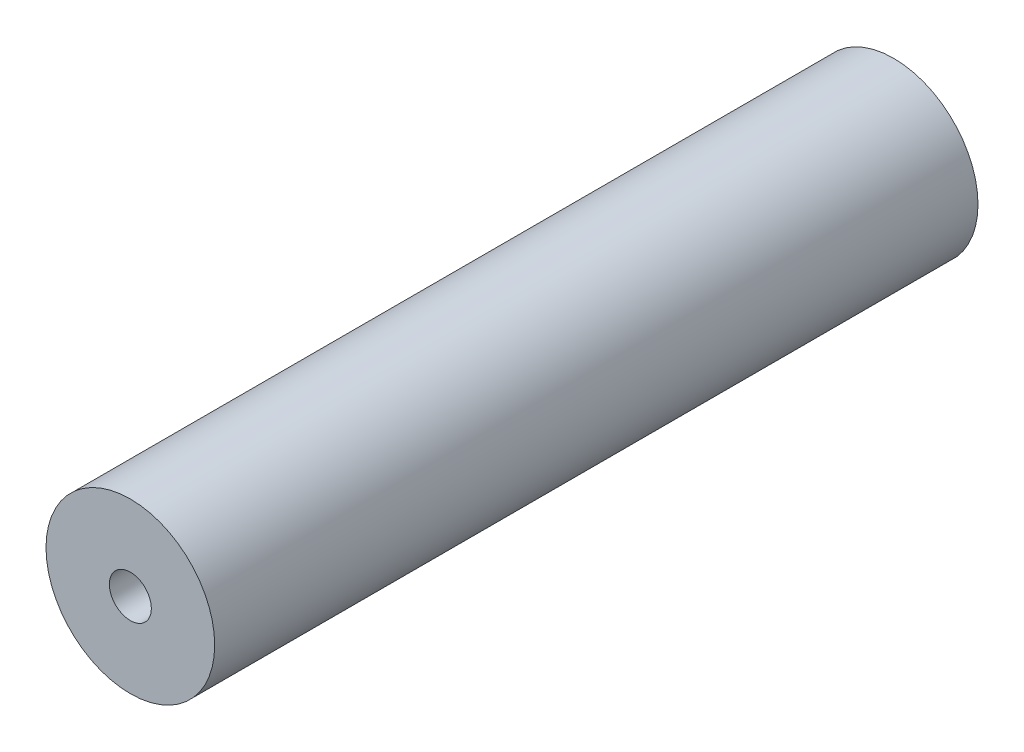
ISO-10303-21;
HEADER;
FILE_DESCRIPTION(('STEP AP214'),'2;1');
FILE_NAME('part.step','',(''),(''),'','','');
FILE_SCHEMA(('AUTOMOTIVE_DESIGN { 1 0 10303 214 1 1 1 1 }'));
ENDSEC;
DATA;
#1=APPLICATION_CONTEXT('core data for automotive mechanical design processes');
#2=APPLICATION_PROTOCOL_DEFINITION('international standard','automotive_design',2000,#1);
#3=PRODUCT_CONTEXT('',#1,'mechanical');
#4=PRODUCT('Part','Part','',(#3));
#5=PRODUCT_RELATED_PRODUCT_CATEGORY('part','',(#4));
#6=PRODUCT_DEFINITION_FORMATION('','',#4);
#7=PRODUCT_DEFINITION_CONTEXT('part definition',#1,'design');
#8=PRODUCT_DEFINITION('design','',#6,#7);
#9=PRODUCT_DEFINITION_SHAPE('','',#8);
#10=(LENGTH_UNIT() NAMED_UNIT(*) SI_UNIT(.MILLI.,.METRE.));
#11=(NAMED_UNIT(*) PLANE_ANGLE_UNIT() SI_UNIT($,.RADIAN.));
#12=(NAMED_UNIT(*) SI_UNIT($,.STERADIAN.) SOLID_ANGLE_UNIT());
#13=UNCERTAINTY_MEASURE_WITH_UNIT(LENGTH_MEASURE(1.E-05),#10,'distance_accuracy_value','');
#14=(GEOMETRIC_REPRESENTATION_CONTEXT(3) GLOBAL_UNCERTAINTY_ASSIGNED_CONTEXT((#13)) GLOBAL_UNIT_ASSIGNED_CONTEXT((#10,
#11,#12)) REPRESENTATION_CONTEXT('',''));
#15=CARTESIAN_POINT('',(0.,0.,0.));
#16=DIRECTION('',(0.,0.,1.));
#17=DIRECTION('',(1.,0.,0.));
#18=AXIS2_PLACEMENT_3D('',#15,#16,#17);
#19=CARTESIAN_POINT('',(226.452282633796,84.1999999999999,90.5));
#20=DIRECTION('',(0.,0.,-1.));
#21=DIRECTION('',(-1.,0.,0.));
#22=AXIS2_PLACEMENT_3D('',#19,#20,#21);
#23=CYLINDRICAL_SURFACE('',#22,2.4892);
#24=CARTESIAN_POINT('',(226.452282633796,84.1999999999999,90.5));
#25=DIRECTION('',(0.,0.,1.));
#26=DIRECTION('',(1.,0.,0.));
#27=AXIS2_PLACEMENT_3D('',#24,#25,#26);
#28=CIRCLE('',#27,2.4892);
#29=CARTESIAN_POINT('',(228.941482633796,84.1999999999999,90.5));
#30=VERTEX_POINT('',#29);
#31=EDGE_CURVE('E46',#30,#30,#28,.T.);
#32=ORIENTED_EDGE('',*,*,#31,.T.);
#33=EDGE_LOOP('',(#32));
#34=FACE_BOUND('',#33,.T.);
#35=CARTESIAN_POINT('',(226.452282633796,84.1999999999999,0.));
#36=DIRECTION('',(0.,0.,1.));
#37=DIRECTION('',(1.,0.,0.));
#38=AXIS2_PLACEMENT_3D('',#35,#36,#37);
#39=CIRCLE('',#38,2.4892);
#40=CARTESIAN_POINT('',(228.941482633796,84.1999999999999,0.));
#41=VERTEX_POINT('',#40);
#42=EDGE_CURVE('E52',#41,#41,#39,.T.);
#43=ORIENTED_EDGE('',*,*,#42,.F.);
#44=EDGE_LOOP('',(#43));
#45=FACE_BOUND('',#44,.T.);
#46=ADVANCED_FACE('F39',(#34,#45),#23,.F.);
#47=CARTESIAN_POINT('',(226.452282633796,84.1999999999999,90.5));
#48=DIRECTION('',(0.,0.,-1.));
#49=DIRECTION('',(-1.,0.,0.));
#50=AXIS2_PLACEMENT_3D('',#47,#48,#49);
#51=CYLINDRICAL_SURFACE('',#50,10.);
#52=CARTESIAN_POINT('',(226.452282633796,84.1999999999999,90.5));
#53=DIRECTION('',(0.,0.,1.));
#54=DIRECTION('',(1.,0.,0.));
#55=AXIS2_PLACEMENT_3D('',#52,#53,#54);
#56=CIRCLE('',#55,10.);
#57=CARTESIAN_POINT('',(236.452282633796,84.1999999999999,90.5));
#58=VERTEX_POINT('',#57);
#59=EDGE_CURVE('E10',#58,#58,#56,.T.);
#60=ORIENTED_EDGE('',*,*,#59,.F.);
#61=EDGE_LOOP('',(#60));
#62=FACE_BOUND('',#61,.T.);
#63=CARTESIAN_POINT('',(226.452282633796,84.1999999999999,0.));
#64=DIRECTION('',(0.,0.,1.));
#65=DIRECTION('',(1.,0.,0.));
#66=AXIS2_PLACEMENT_3D('',#63,#64,#65);
#67=CIRCLE('',#66,10.);
#68=CARTESIAN_POINT('',(236.452282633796,84.1999999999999,0.));
#69=VERTEX_POINT('',#68);
#70=EDGE_CURVE('E42',#69,#69,#67,.T.);
#71=ORIENTED_EDGE('',*,*,#70,.T.);
#72=EDGE_LOOP('',(#71));
#73=FACE_BOUND('',#72,.T.);
#74=ADVANCED_FACE('F59',(#62,#73),#51,.T.);
#75=CARTESIAN_POINT('',(0.,0.,90.5));
#76=DIRECTION('',(0.,0.,1.));
#77=DIRECTION('',(1.,0.,0.));
#78=AXIS2_PLACEMENT_3D('',#75,#76,#77);
#79=PLANE('',#78);
#80=ORIENTED_EDGE('',*,*,#31,.F.);
#81=EDGE_LOOP('',(#80));
#82=FACE_BOUND('',#81,.T.);
#83=ORIENTED_EDGE('',*,*,#59,.T.);
#84=EDGE_LOOP('',(#83));
#85=FACE_BOUND('',#84,.T.);
#86=ADVANCED_FACE('F63',(#82,#85),#79,.T.);
#87=CARTESIAN_POINT('',(0.,0.,0.));
#88=DIRECTION('',(0.,0.,1.));
#89=DIRECTION('',(1.,0.,0.));
#90=AXIS2_PLACEMENT_3D('',#87,#88,#89);
#91=PLANE('',#90);
#92=ORIENTED_EDGE('',*,*,#42,.T.);
#93=EDGE_LOOP('',(#92));
#94=FACE_BOUND('',#93,.T.);
#95=ORIENTED_EDGE('',*,*,#70,.F.);
#96=EDGE_LOOP('',(#95));
#97=FACE_BOUND('',#96,.T.);
#98=ADVANCED_FACE('F61',(#94,#97),#91,.F.);
#99=CLOSED_SHELL('',(#46,#74,#86,#98));
#100=MANIFOLD_SOLID_BREP('B2',#99);
#101=ADVANCED_BREP_SHAPE_REPRESENTATION('',(#18,#100),#14);
#102=SHAPE_DEFINITION_REPRESENTATION(#9,#101);
ENDSEC;
END-ISO-10303-21;
